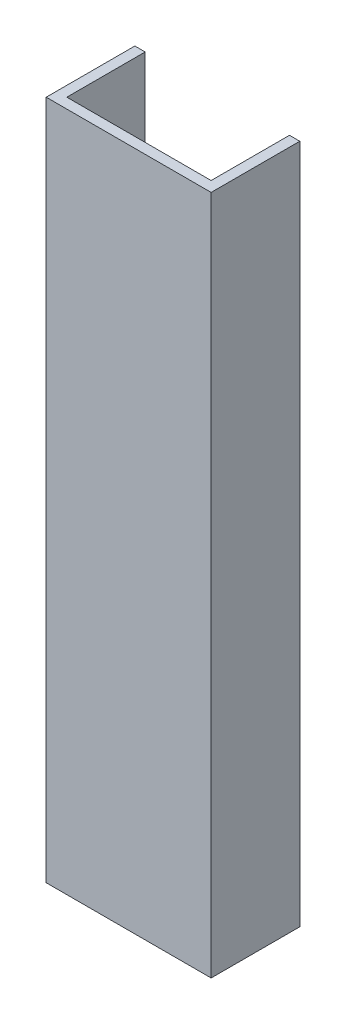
ISO-10303-21;
HEADER;
FILE_DESCRIPTION(('STEP AP214'),'2;1');
FILE_NAME('part.step','',(''),(''),'','','');
FILE_SCHEMA(('AUTOMOTIVE_DESIGN { 1 0 10303 214 1 1 1 1 }'));
ENDSEC;
DATA;
#1=APPLICATION_CONTEXT('core data for automotive mechanical design processes');
#2=APPLICATION_PROTOCOL_DEFINITION('international standard','automotive_design',2000,#1);
#3=PRODUCT_CONTEXT('',#1,'mechanical');
#4=PRODUCT('Part','Part','',(#3));
#5=PRODUCT_RELATED_PRODUCT_CATEGORY('part','',(#4));
#6=PRODUCT_DEFINITION_FORMATION('','',#4);
#7=PRODUCT_DEFINITION_CONTEXT('part definition',#1,'design');
#8=PRODUCT_DEFINITION('design','',#6,#7);
#9=PRODUCT_DEFINITION_SHAPE('','',#8);
#10=(LENGTH_UNIT() NAMED_UNIT(*) SI_UNIT(.MILLI.,.METRE.));
#11=(NAMED_UNIT(*) PLANE_ANGLE_UNIT() SI_UNIT($,.RADIAN.));
#12=(NAMED_UNIT(*) SI_UNIT($,.STERADIAN.) SOLID_ANGLE_UNIT());
#13=UNCERTAINTY_MEASURE_WITH_UNIT(LENGTH_MEASURE(1.E-05),#10,'distance_accuracy_value','');
#14=(GEOMETRIC_REPRESENTATION_CONTEXT(3) GLOBAL_UNCERTAINTY_ASSIGNED_CONTEXT((#13)) GLOBAL_UNIT_ASSIGNED_CONTEXT((#10,
#11,#12)) REPRESENTATION_CONTEXT('',''));
#15=CARTESIAN_POINT('',(0.,0.,0.));
#16=DIRECTION('',(0.,0.,1.));
#17=DIRECTION('',(1.,0.,0.));
#18=AXIS2_PLACEMENT_3D('',#15,#16,#17);
#19=CARTESIAN_POINT('',(35.,330.,-43.));
#20=DIRECTION('',(0.,0.,1.));
#21=DIRECTION('',(1.,0.,0.));
#22=AXIS2_PLACEMENT_3D('',#19,#20,#21);
#23=PLANE('',#22);
#24=DIRECTION('',(-1.,0.,0.));
#25=VECTOR('',#24,1.);
#26=CARTESIAN_POINT('',(35.,0.,-43.));
#27=LINE('',#26,#25);
#28=CARTESIAN_POINT('',(40.,0.,-43.));
#29=VERTEX_POINT('',#28);
#30=CARTESIAN_POINT('',(35.,0.,-43.));
#31=VERTEX_POINT('',#30);
#32=EDGE_CURVE('E129',#29,#31,#27,.T.);
#33=ORIENTED_EDGE('',*,*,#32,.T.);
#34=DIRECTION('',(0.,-1.,0.));
#35=VECTOR('',#34,1.);
#36=CARTESIAN_POINT('',(35.,330.,-43.));
#37=LINE('',#36,#35);
#38=CARTESIAN_POINT('',(35.,330.,-43.));
#39=VERTEX_POINT('',#38);
#40=EDGE_CURVE('E11',#39,#31,#37,.T.);
#41=ORIENTED_EDGE('',*,*,#40,.F.);
#42=DIRECTION('',(-1.,0.,0.));
#43=VECTOR('',#42,1.);
#44=CARTESIAN_POINT('',(35.,330.,-43.));
#45=LINE('',#44,#43);
#46=CARTESIAN_POINT('',(40.,330.,-43.));
#47=VERTEX_POINT('',#46);
#48=EDGE_CURVE('E143',#47,#39,#45,.T.);
#49=ORIENTED_EDGE('',*,*,#48,.F.);
#50=DIRECTION('',(0.,-1.,0.));
#51=VECTOR('',#50,1.);
#52=CARTESIAN_POINT('',(40.,330.,-43.));
#53=LINE('',#52,#51);
#54=EDGE_CURVE('E125',#47,#29,#53,.T.);
#55=ORIENTED_EDGE('',*,*,#54,.T.);
#56=EDGE_LOOP('',(#33,#41,#49,#55));
#57=FACE_BOUND('',#56,.T.);
#58=ADVANCED_FACE('F33',(#57),#23,.F.);
#59=CARTESIAN_POINT('',(35.,330.,-43.));
#60=DIRECTION('',(1.,0.,0.));
#61=DIRECTION('',(0.,0.,-1.));
#62=AXIS2_PLACEMENT_3D('',#59,#60,#61);
#63=PLANE('',#62);
#64=DIRECTION('',(0.,0.,1.));
#65=VECTOR('',#64,1.);
#66=CARTESIAN_POINT('',(35.,0.,-43.));
#67=LINE('',#66,#65);
#68=CARTESIAN_POINT('',(35.,0.,-4.99999999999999));
#69=VERTEX_POINT('',#68);
#70=EDGE_CURVE('E132',#31,#69,#67,.T.);
#71=ORIENTED_EDGE('',*,*,#70,.T.);
#72=DIRECTION('',(0.,-1.,0.));
#73=VECTOR('',#72,1.);
#74=CARTESIAN_POINT('',(35.,330.,-4.99999999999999));
#75=LINE('',#74,#73);
#76=CARTESIAN_POINT('',(35.,330.,-4.99999999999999));
#77=VERTEX_POINT('',#76);
#78=EDGE_CURVE('E41',#77,#69,#75,.T.);
#79=ORIENTED_EDGE('',*,*,#78,.F.);
#80=DIRECTION('',(0.,0.,1.));
#81=VECTOR('',#80,1.);
#82=CARTESIAN_POINT('',(35.,330.,-43.));
#83=LINE('',#82,#81);
#84=EDGE_CURVE('E92',#39,#77,#83,.T.);
#85=ORIENTED_EDGE('',*,*,#84,.F.);
#86=ORIENTED_EDGE('',*,*,#40,.T.);
#87=EDGE_LOOP('',(#71,#79,#85,#86));
#88=FACE_BOUND('',#87,.T.);
#89=ADVANCED_FACE('F178',(#88),#63,.F.);
#90=CARTESIAN_POINT('',(35.,330.,-4.99999999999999));
#91=DIRECTION('',(0.,0.,1.));
#92=DIRECTION('',(1.,0.,0.));
#93=AXIS2_PLACEMENT_3D('',#90,#91,#92);
#94=PLANE('',#93);
#95=DIRECTION('',(-1.,0.,0.));
#96=VECTOR('',#95,1.);
#97=CARTESIAN_POINT('',(35.,0.,-4.99999999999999));
#98=LINE('',#97,#96);
#99=CARTESIAN_POINT('',(-35.,0.,-4.99999999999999));
#100=VERTEX_POINT('',#99);
#101=EDGE_CURVE('E134',#69,#100,#98,.T.);
#102=ORIENTED_EDGE('',*,*,#101,.T.);
#103=DIRECTION('',(0.,-1.,0.));
#104=VECTOR('',#103,1.);
#105=CARTESIAN_POINT('',(-35.,330.,-4.99999999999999));
#106=LINE('',#105,#104);
#107=CARTESIAN_POINT('',(-35.,330.,-4.99999999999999));
#108=VERTEX_POINT('',#107);
#109=EDGE_CURVE('E150',#108,#100,#106,.T.);
#110=ORIENTED_EDGE('',*,*,#109,.F.);
#111=DIRECTION('',(-1.,0.,0.));
#112=VECTOR('',#111,1.);
#113=CARTESIAN_POINT('',(35.,330.,-4.99999999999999));
#114=LINE('',#113,#112);
#115=EDGE_CURVE('E158',#77,#108,#114,.T.);
#116=ORIENTED_EDGE('',*,*,#115,.F.);
#117=ORIENTED_EDGE('',*,*,#78,.T.);
#118=EDGE_LOOP('',(#102,#110,#116,#117));
#119=FACE_BOUND('',#118,.T.);
#120=ADVANCED_FACE('F156',(#119),#94,.F.);
#121=CARTESIAN_POINT('',(-35.,330.,-4.99999999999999));
#122=DIRECTION('',(-1.,0.,0.));
#123=DIRECTION('',(0.,0.,1.));
#124=AXIS2_PLACEMENT_3D('',#121,#122,#123);
#125=PLANE('',#124);
#126=DIRECTION('',(0.,0.,-1.));
#127=VECTOR('',#126,1.);
#128=CARTESIAN_POINT('',(-35.,0.,-4.99999999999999));
#129=LINE('',#128,#127);
#130=CARTESIAN_POINT('',(-35.,0.,-43.));
#131=VERTEX_POINT('',#130);
#132=EDGE_CURVE('E136',#100,#131,#129,.T.);
#133=ORIENTED_EDGE('',*,*,#132,.T.);
#134=DIRECTION('',(0.,-1.,0.));
#135=VECTOR('',#134,1.);
#136=CARTESIAN_POINT('',(-35.,330.,-43.));
#137=LINE('',#136,#135);
#138=CARTESIAN_POINT('',(-35.,330.,-43.));
#139=VERTEX_POINT('',#138);
#140=EDGE_CURVE('E147',#139,#131,#137,.T.);
#141=ORIENTED_EDGE('',*,*,#140,.F.);
#142=DIRECTION('',(0.,0.,-1.));
#143=VECTOR('',#142,1.);
#144=CARTESIAN_POINT('',(-35.,330.,-4.99999999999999));
#145=LINE('',#144,#143);
#146=EDGE_CURVE('E170',#108,#139,#145,.T.);
#147=ORIENTED_EDGE('',*,*,#146,.F.);
#148=ORIENTED_EDGE('',*,*,#109,.T.);
#149=EDGE_LOOP('',(#133,#141,#147,#148));
#150=FACE_BOUND('',#149,.T.);
#151=ADVANCED_FACE('F166',(#150),#125,.F.);
#152=CARTESIAN_POINT('',(-40.,330.,-43.));
#153=DIRECTION('',(0.,0.,1.));
#154=DIRECTION('',(1.,0.,0.));
#155=AXIS2_PLACEMENT_3D('',#152,#153,#154);
#156=PLANE('',#155);
#157=DIRECTION('',(-1.,0.,0.));
#158=VECTOR('',#157,1.);
#159=CARTESIAN_POINT('',(-40.,0.,-43.));
#160=LINE('',#159,#158);
#161=CARTESIAN_POINT('',(-40.,0.,-43.));
#162=VERTEX_POINT('',#161);
#163=EDGE_CURVE('E138',#131,#162,#160,.T.);
#164=ORIENTED_EDGE('',*,*,#163,.T.);
#165=DIRECTION('',(0.,-1.,0.));
#166=VECTOR('',#165,1.);
#167=CARTESIAN_POINT('',(-40.,330.,-43.));
#168=LINE('',#167,#166);
#169=CARTESIAN_POINT('',(-40.,330.,-43.));
#170=VERTEX_POINT('',#169);
#171=EDGE_CURVE('E120',#170,#162,#168,.T.);
#172=ORIENTED_EDGE('',*,*,#171,.F.);
#173=DIRECTION('',(-1.,0.,0.));
#174=VECTOR('',#173,1.);
#175=CARTESIAN_POINT('',(-40.,330.,-43.));
#176=LINE('',#175,#174);
#177=EDGE_CURVE('E111',#139,#170,#176,.T.);
#178=ORIENTED_EDGE('',*,*,#177,.F.);
#179=ORIENTED_EDGE('',*,*,#140,.T.);
#180=EDGE_LOOP('',(#164,#172,#178,#179));
#181=FACE_BOUND('',#180,.T.);
#182=ADVANCED_FACE('F169',(#181),#156,.F.);
#183=CARTESIAN_POINT('',(-40.,330.,0.));
#184=DIRECTION('',(1.,0.,0.));
#185=DIRECTION('',(0.,0.,-1.));
#186=AXIS2_PLACEMENT_3D('',#183,#184,#185);
#187=PLANE('',#186);
#188=DIRECTION('',(0.,0.,1.));
#189=VECTOR('',#188,1.);
#190=CARTESIAN_POINT('',(-40.,0.,0.));
#191=LINE('',#190,#189);
#192=CARTESIAN_POINT('',(-40.,0.,0.));
#193=VERTEX_POINT('',#192);
#194=EDGE_CURVE('E119',#162,#193,#191,.T.);
#195=ORIENTED_EDGE('',*,*,#194,.T.);
#196=DIRECTION('',(0.,-1.,0.));
#197=VECTOR('',#196,1.);
#198=CARTESIAN_POINT('',(-40.,330.,0.));
#199=LINE('',#198,#197);
#200=CARTESIAN_POINT('',(-40.,330.,0.));
#201=VERTEX_POINT('',#200);
#202=EDGE_CURVE('E116',#201,#193,#199,.T.);
#203=ORIENTED_EDGE('',*,*,#202,.F.);
#204=DIRECTION('',(0.,0.,1.));
#205=VECTOR('',#204,1.);
#206=CARTESIAN_POINT('',(-40.,330.,0.));
#207=LINE('',#206,#205);
#208=EDGE_CURVE('E105',#170,#201,#207,.T.);
#209=ORIENTED_EDGE('',*,*,#208,.F.);
#210=ORIENTED_EDGE('',*,*,#171,.T.);
#211=EDGE_LOOP('',(#195,#203,#209,#210));
#212=FACE_BOUND('',#211,.T.);
#213=ADVANCED_FACE('F117',(#212),#187,.F.);
#214=CARTESIAN_POINT('',(-40.,330.,0.));
#215=DIRECTION('',(0.,0.,-1.));
#216=DIRECTION('',(-1.,0.,0.));
#217=AXIS2_PLACEMENT_3D('',#214,#215,#216);
#218=PLANE('',#217);
#219=DIRECTION('',(1.,0.,0.));
#220=VECTOR('',#219,1.);
#221=CARTESIAN_POINT('',(-40.,0.,0.));
#222=LINE('',#221,#220);
#223=CARTESIAN_POINT('',(40.,0.,0.));
#224=VERTEX_POINT('',#223);
#225=EDGE_CURVE('E78',#193,#224,#222,.T.);
#226=ORIENTED_EDGE('',*,*,#225,.T.);
#227=DIRECTION('',(0.,-1.,0.));
#228=VECTOR('',#227,1.);
#229=CARTESIAN_POINT('',(40.,330.,0.));
#230=LINE('',#229,#228);
#231=CARTESIAN_POINT('',(40.,330.,0.));
#232=VERTEX_POINT('',#231);
#233=EDGE_CURVE('E121',#232,#224,#230,.T.);
#234=ORIENTED_EDGE('',*,*,#233,.F.);
#235=DIRECTION('',(1.,0.,0.));
#236=VECTOR('',#235,1.);
#237=CARTESIAN_POINT('',(-40.,330.,0.));
#238=LINE('',#237,#236);
#239=EDGE_CURVE('E109',#201,#232,#238,.T.);
#240=ORIENTED_EDGE('',*,*,#239,.F.);
#241=ORIENTED_EDGE('',*,*,#202,.T.);
#242=EDGE_LOOP('',(#226,#234,#240,#241));
#243=FACE_BOUND('',#242,.T.);
#244=ADVANCED_FACE('F123',(#243),#218,.F.);
#245=CARTESIAN_POINT('',(40.,330.,0.));
#246=DIRECTION('',(-1.,0.,0.));
#247=DIRECTION('',(0.,0.,1.));
#248=AXIS2_PLACEMENT_3D('',#245,#246,#247);
#249=PLANE('',#248);
#250=DIRECTION('',(0.,0.,-1.));
#251=VECTOR('',#250,1.);
#252=CARTESIAN_POINT('',(40.,0.,0.));
#253=LINE('',#252,#251);
#254=EDGE_CURVE('E84',#224,#29,#253,.T.);
#255=ORIENTED_EDGE('',*,*,#254,.T.);
#256=ORIENTED_EDGE('',*,*,#54,.F.);
#257=DIRECTION('',(0.,0.,-1.));
#258=VECTOR('',#257,1.);
#259=CARTESIAN_POINT('',(40.,330.,0.));
#260=LINE('',#259,#258);
#261=EDGE_CURVE('E49',#232,#47,#260,.T.);
#262=ORIENTED_EDGE('',*,*,#261,.F.);
#263=ORIENTED_EDGE('',*,*,#233,.T.);
#264=EDGE_LOOP('',(#255,#256,#262,#263));
#265=FACE_BOUND('',#264,.T.);
#266=ADVANCED_FACE('F194',(#265),#249,.F.);
#267=CARTESIAN_POINT('',(0.,330.,0.));
#268=DIRECTION('',(0.,1.,0.));
#269=DIRECTION('',(0.,0.,1.));
#270=AXIS2_PLACEMENT_3D('',#267,#268,#269);
#271=PLANE('',#270);
#272=ORIENTED_EDGE('',*,*,#48,.T.);
#273=ORIENTED_EDGE('',*,*,#84,.T.);
#274=ORIENTED_EDGE('',*,*,#115,.T.);
#275=ORIENTED_EDGE('',*,*,#146,.T.);
#276=ORIENTED_EDGE('',*,*,#177,.T.);
#277=ORIENTED_EDGE('',*,*,#208,.T.);
#278=ORIENTED_EDGE('',*,*,#239,.T.);
#279=ORIENTED_EDGE('',*,*,#261,.T.);
#280=EDGE_LOOP('',(#272,#273,#274,#275,#276,#277,#278,#279));
#281=FACE_BOUND('',#280,.T.);
#282=ADVANCED_FACE('F107',(#281),#271,.T.);
#283=CARTESIAN_POINT('',(0.,0.,0.));
#284=DIRECTION('',(0.,1.,0.));
#285=DIRECTION('',(0.,0.,1.));
#286=AXIS2_PLACEMENT_3D('',#283,#284,#285);
#287=PLANE('',#286);
#288=ORIENTED_EDGE('',*,*,#32,.F.);
#289=ORIENTED_EDGE('',*,*,#254,.F.);
#290=ORIENTED_EDGE('',*,*,#225,.F.);
#291=ORIENTED_EDGE('',*,*,#194,.F.);
#292=ORIENTED_EDGE('',*,*,#163,.F.);
#293=ORIENTED_EDGE('',*,*,#132,.F.);
#294=ORIENTED_EDGE('',*,*,#101,.F.);
#295=ORIENTED_EDGE('',*,*,#70,.F.);
#296=EDGE_LOOP('',(#288,#289,#290,#291,#292,#293,#294,#295));
#297=FACE_BOUND('',#296,.T.);
#298=ADVANCED_FACE('F162',(#297),#287,.F.);
#299=CLOSED_SHELL('',(#58,#89,#120,#151,#182,#213,#244,#266,#282,#298));
#300=MANIFOLD_SOLID_BREP('B2',#299);
#301=ADVANCED_BREP_SHAPE_REPRESENTATION('',(#18,#300),#14);
#302=SHAPE_DEFINITION_REPRESENTATION(#9,#301);
ENDSEC;
END-ISO-10303-21;
